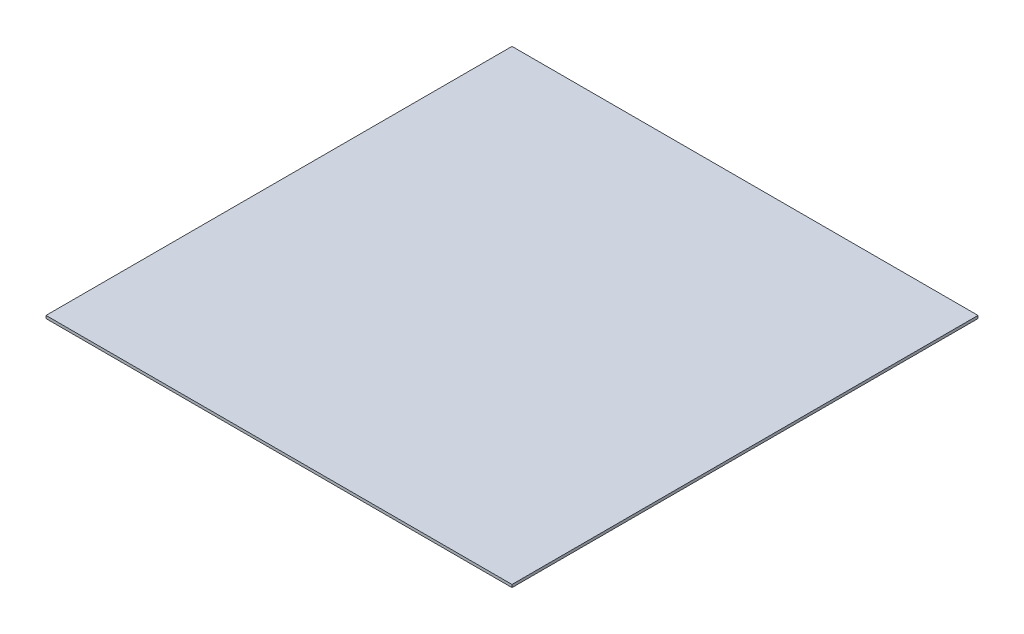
ISO-10303-21;
HEADER;
FILE_DESCRIPTION(('STEP AP214'),'2;1');
FILE_NAME('part.step','',(''),(''),'','','');
FILE_SCHEMA(('AUTOMOTIVE_DESIGN { 1 0 10303 214 1 1 1 1 }'));
ENDSEC;
DATA;
#1=APPLICATION_CONTEXT('core data for automotive mechanical design processes');
#2=APPLICATION_PROTOCOL_DEFINITION('international standard','automotive_design',2000,#1);
#3=PRODUCT_CONTEXT('',#1,'mechanical');
#4=PRODUCT('Part','Part','',(#3));
#5=PRODUCT_RELATED_PRODUCT_CATEGORY('part','',(#4));
#6=PRODUCT_DEFINITION_FORMATION('','',#4);
#7=PRODUCT_DEFINITION_CONTEXT('part definition',#1,'design');
#8=PRODUCT_DEFINITION('design','',#6,#7);
#9=PRODUCT_DEFINITION_SHAPE('','',#8);
#10=(LENGTH_UNIT() NAMED_UNIT(*) SI_UNIT(.MILLI.,.METRE.));
#11=(NAMED_UNIT(*) PLANE_ANGLE_UNIT() SI_UNIT($,.RADIAN.));
#12=(NAMED_UNIT(*) SI_UNIT($,.STERADIAN.) SOLID_ANGLE_UNIT());
#13=UNCERTAINTY_MEASURE_WITH_UNIT(LENGTH_MEASURE(1.E-05),#10,'distance_accuracy_value','');
#14=(GEOMETRIC_REPRESENTATION_CONTEXT(3) GLOBAL_UNCERTAINTY_ASSIGNED_CONTEXT((#13)) GLOBAL_UNIT_ASSIGNED_CONTEXT((#10,
#11,#12)) REPRESENTATION_CONTEXT('',''));
#15=CARTESIAN_POINT('',(0.,0.,0.));
#16=DIRECTION('',(0.,0.,1.));
#17=DIRECTION('',(1.,0.,0.));
#18=AXIS2_PLACEMENT_3D('',#15,#16,#17);
#19=CARTESIAN_POINT('',(533.4,6.35,-533.4));
#20=DIRECTION('',(-1.,0.,0.));
#21=DIRECTION('',(0.,0.,1.));
#22=AXIS2_PLACEMENT_3D('',#19,#20,#21);
#23=PLANE('',#22);
#24=DIRECTION('',(0.,0.,-1.));
#25=VECTOR('',#24,1.);
#26=CARTESIAN_POINT('',(533.4,0.,-533.4));
#27=LINE('',#26,#25);
#28=CARTESIAN_POINT('',(533.4,0.,533.4));
#29=VERTEX_POINT('',#28);
#30=CARTESIAN_POINT('',(533.4,0.,-533.4));
#31=VERTEX_POINT('',#30);
#32=EDGE_CURVE('E100',#29,#31,#27,.T.);
#33=ORIENTED_EDGE('',*,*,#32,.T.);
#34=DIRECTION('',(0.,-1.,0.));
#35=VECTOR('',#34,1.);
#36=CARTESIAN_POINT('',(533.4,6.35,-533.4));
#37=LINE('',#36,#35);
#38=CARTESIAN_POINT('',(533.4,6.35,-533.4));
#39=VERTEX_POINT('',#38);
#40=EDGE_CURVE('E11',#39,#31,#37,.T.);
#41=ORIENTED_EDGE('',*,*,#40,.F.);
#42=DIRECTION('',(0.,0.,-1.));
#43=VECTOR('',#42,1.);
#44=CARTESIAN_POINT('',(533.4,6.35,-533.4));
#45=LINE('',#44,#43);
#46=CARTESIAN_POINT('',(533.4,6.35,533.4));
#47=VERTEX_POINT('',#46);
#48=EDGE_CURVE('E88',#47,#39,#45,.T.);
#49=ORIENTED_EDGE('',*,*,#48,.F.);
#50=DIRECTION('',(0.,-1.,0.));
#51=VECTOR('',#50,1.);
#52=CARTESIAN_POINT('',(533.4,6.35,533.4));
#53=LINE('',#52,#51);
#54=EDGE_CURVE('E96',#47,#29,#53,.T.);
#55=ORIENTED_EDGE('',*,*,#54,.T.);
#56=EDGE_LOOP('',(#33,#41,#49,#55));
#57=FACE_BOUND('',#56,.T.);
#58=ADVANCED_FACE('F37',(#57),#23,.F.);
#59=CARTESIAN_POINT('',(-533.4,6.35,-533.4));
#60=DIRECTION('',(0.,0.,1.));
#61=DIRECTION('',(1.,0.,0.));
#62=AXIS2_PLACEMENT_3D('',#59,#60,#61);
#63=PLANE('',#62);
#64=DIRECTION('',(-1.,0.,0.));
#65=VECTOR('',#64,1.);
#66=CARTESIAN_POINT('',(-533.4,0.,-533.4));
#67=LINE('',#66,#65);
#68=CARTESIAN_POINT('',(-533.4,0.,-533.4));
#69=VERTEX_POINT('',#68);
#70=EDGE_CURVE('E92',#31,#69,#67,.T.);
#71=ORIENTED_EDGE('',*,*,#70,.T.);
#72=DIRECTION('',(0.,-1.,0.));
#73=VECTOR('',#72,1.);
#74=CARTESIAN_POINT('',(-533.4,6.35,-533.4));
#75=LINE('',#74,#73);
#76=CARTESIAN_POINT('',(-533.4,6.35,-533.4));
#77=VERTEX_POINT('',#76);
#78=EDGE_CURVE('E45',#77,#69,#75,.T.);
#79=ORIENTED_EDGE('',*,*,#78,.F.);
#80=DIRECTION('',(-1.,0.,0.));
#81=VECTOR('',#80,1.);
#82=CARTESIAN_POINT('',(-533.4,6.35,-533.4));
#83=LINE('',#82,#81);
#84=EDGE_CURVE('E83',#39,#77,#83,.T.);
#85=ORIENTED_EDGE('',*,*,#84,.F.);
#86=ORIENTED_EDGE('',*,*,#40,.T.);
#87=EDGE_LOOP('',(#71,#79,#85,#86));
#88=FACE_BOUND('',#87,.T.);
#89=ADVANCED_FACE('F91',(#88),#63,.F.);
#90=CARTESIAN_POINT('',(-533.4,6.35,-533.4));
#91=DIRECTION('',(1.,0.,0.));
#92=DIRECTION('',(0.,0.,-1.));
#93=AXIS2_PLACEMENT_3D('',#90,#91,#92);
#94=PLANE('',#93);
#95=DIRECTION('',(0.,0.,1.));
#96=VECTOR('',#95,1.);
#97=CARTESIAN_POINT('',(-533.4,0.,-533.4));
#98=LINE('',#97,#96);
#99=CARTESIAN_POINT('',(-533.4,0.,533.4));
#100=VERTEX_POINT('',#99);
#101=EDGE_CURVE('E70',#69,#100,#98,.T.);
#102=ORIENTED_EDGE('',*,*,#101,.T.);
#103=DIRECTION('',(0.,-1.,0.));
#104=VECTOR('',#103,1.);
#105=CARTESIAN_POINT('',(-533.4,6.35,533.4));
#106=LINE('',#105,#104);
#107=CARTESIAN_POINT('',(-533.4,6.35,533.4));
#108=VERTEX_POINT('',#107);
#109=EDGE_CURVE('E93',#108,#100,#106,.T.);
#110=ORIENTED_EDGE('',*,*,#109,.F.);
#111=DIRECTION('',(0.,0.,1.));
#112=VECTOR('',#111,1.);
#113=CARTESIAN_POINT('',(-533.4,6.35,-533.4));
#114=LINE('',#113,#112);
#115=EDGE_CURVE('E86',#77,#108,#114,.T.);
#116=ORIENTED_EDGE('',*,*,#115,.F.);
#117=ORIENTED_EDGE('',*,*,#78,.T.);
#118=EDGE_LOOP('',(#102,#110,#116,#117));
#119=FACE_BOUND('',#118,.T.);
#120=ADVANCED_FACE('F94',(#119),#94,.F.);
#121=CARTESIAN_POINT('',(-533.4,6.35,533.4));
#122=DIRECTION('',(0.,0.,-1.));
#123=DIRECTION('',(-1.,0.,0.));
#124=AXIS2_PLACEMENT_3D('',#121,#122,#123);
#125=PLANE('',#124);
#126=DIRECTION('',(1.,0.,0.));
#127=VECTOR('',#126,1.);
#128=CARTESIAN_POINT('',(-533.4,0.,533.4));
#129=LINE('',#128,#127);
#130=EDGE_CURVE('E76',#100,#29,#129,.T.);
#131=ORIENTED_EDGE('',*,*,#130,.T.);
#132=ORIENTED_EDGE('',*,*,#54,.F.);
#133=DIRECTION('',(1.,0.,0.));
#134=VECTOR('',#133,1.);
#135=CARTESIAN_POINT('',(-533.4,6.35,533.4));
#136=LINE('',#135,#134);
#137=EDGE_CURVE('E53',#108,#47,#136,.T.);
#138=ORIENTED_EDGE('',*,*,#137,.F.);
#139=ORIENTED_EDGE('',*,*,#109,.T.);
#140=EDGE_LOOP('',(#131,#132,#138,#139));
#141=FACE_BOUND('',#140,.T.);
#142=ADVANCED_FACE('F107',(#141),#125,.F.);
#143=CARTESIAN_POINT('',(0.,6.35,0.));
#144=DIRECTION('',(0.,1.,0.));
#145=DIRECTION('',(0.,0.,1.));
#146=AXIS2_PLACEMENT_3D('',#143,#144,#145);
#147=PLANE('',#146);
#148=ORIENTED_EDGE('',*,*,#48,.T.);
#149=ORIENTED_EDGE('',*,*,#84,.T.);
#150=ORIENTED_EDGE('',*,*,#115,.T.);
#151=ORIENTED_EDGE('',*,*,#137,.T.);
#152=EDGE_LOOP('',(#148,#149,#150,#151));
#153=FACE_BOUND('',#152,.T.);
#154=ADVANCED_FACE('F84',(#153),#147,.T.);
#155=CARTESIAN_POINT('',(0.,0.,0.));
#156=DIRECTION('',(0.,1.,0.));
#157=DIRECTION('',(0.,0.,1.));
#158=AXIS2_PLACEMENT_3D('',#155,#156,#157);
#159=PLANE('',#158);
#160=ORIENTED_EDGE('',*,*,#32,.F.);
#161=ORIENTED_EDGE('',*,*,#130,.F.);
#162=ORIENTED_EDGE('',*,*,#101,.F.);
#163=ORIENTED_EDGE('',*,*,#70,.F.);
#164=EDGE_LOOP('',(#160,#161,#162,#163));
#165=FACE_BOUND('',#164,.T.);
#166=ADVANCED_FACE('F110',(#165),#159,.F.);
#167=CLOSED_SHELL('',(#58,#89,#120,#142,#154,#166));
#168=MANIFOLD_SOLID_BREP('B2',#167);
#169=ADVANCED_BREP_SHAPE_REPRESENTATION('',(#18,#168),#14);
#170=SHAPE_DEFINITION_REPRESENTATION(#9,#169);
ENDSEC;
END-ISO-10303-21;
